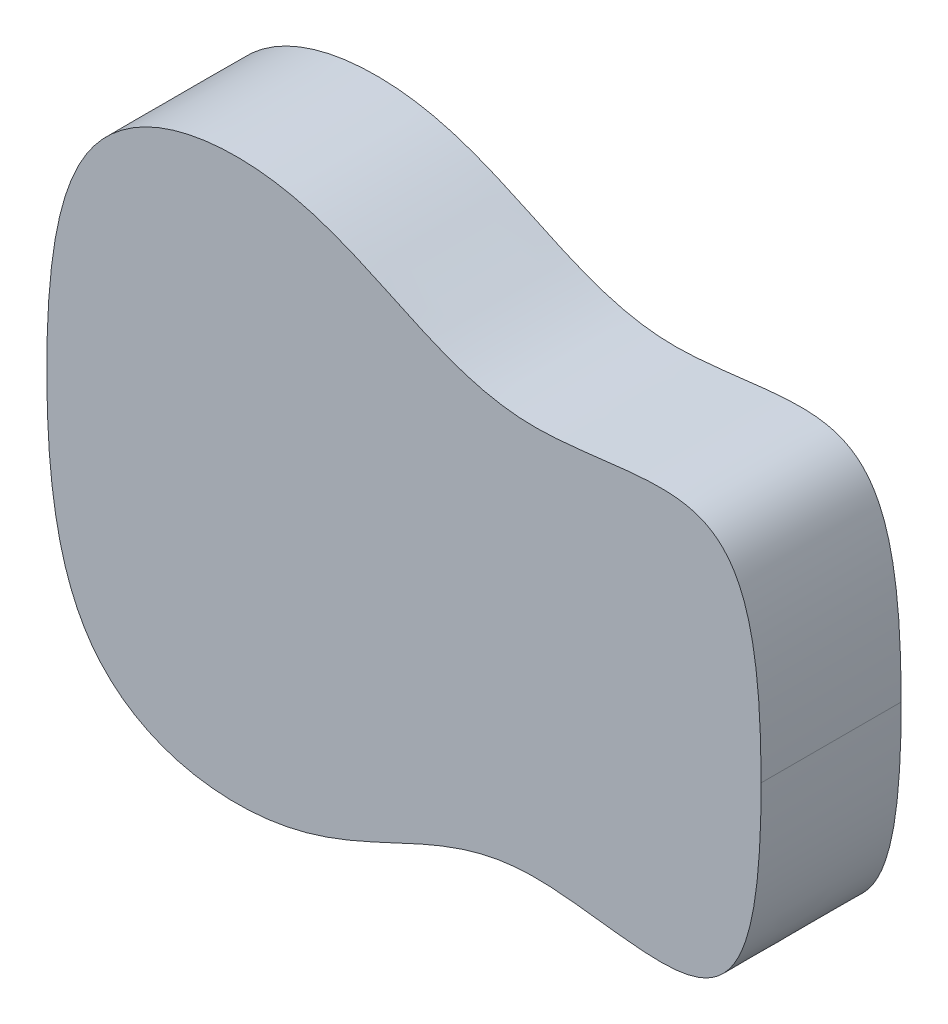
ISO-10303-21;
HEADER;
FILE_DESCRIPTION(('STEP AP214'),'2;1');
FILE_NAME('part.step','',(''),(''),'','','');
FILE_SCHEMA(('AUTOMOTIVE_DESIGN { 1 0 10303 214 1 1 1 1 }'));
ENDSEC;
DATA;
#1=APPLICATION_CONTEXT('core data for automotive mechanical design processes');
#2=APPLICATION_PROTOCOL_DEFINITION('international standard','automotive_design',2000,#1);
#3=PRODUCT_CONTEXT('',#1,'mechanical');
#4=PRODUCT('Part','Part','',(#3));
#5=PRODUCT_RELATED_PRODUCT_CATEGORY('part','',(#4));
#6=PRODUCT_DEFINITION_FORMATION('','',#4);
#7=PRODUCT_DEFINITION_CONTEXT('part definition',#1,'design');
#8=PRODUCT_DEFINITION('design','',#6,#7);
#9=PRODUCT_DEFINITION_SHAPE('','',#8);
#10=(LENGTH_UNIT() NAMED_UNIT(*) SI_UNIT(.MILLI.,.METRE.));
#11=(NAMED_UNIT(*) PLANE_ANGLE_UNIT() SI_UNIT($,.RADIAN.));
#12=(NAMED_UNIT(*) SI_UNIT($,.STERADIAN.) SOLID_ANGLE_UNIT());
#13=UNCERTAINTY_MEASURE_WITH_UNIT(LENGTH_MEASURE(1.E-05),#10,'distance_accuracy_value','');
#14=(GEOMETRIC_REPRESENTATION_CONTEXT(3) GLOBAL_UNCERTAINTY_ASSIGNED_CONTEXT((#13)) GLOBAL_UNIT_ASSIGNED_CONTEXT((#10,
#11,#12)) REPRESENTATION_CONTEXT('',''));
#15=CARTESIAN_POINT('',(0.,0.,0.));
#16=DIRECTION('',(0.,0.,1.));
#17=DIRECTION('',(1.,0.,0.));
#18=AXIS2_PLACEMENT_3D('',#15,#16,#17);
#19=CARTESIAN_POINT('',(0.,0.,100.));
#20=CARTESIAN_POINT('',(0.,-71.6690537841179,100.));
#21=CARTESIAN_POINT('',(21.8850034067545,-187.667022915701,100.));
#22=CARTESIAN_POINT('',(201.910389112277,-219.679273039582,100.));
#23=CARTESIAN_POINT('',(295.60182115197,-117.879681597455,100.));
#24=CARTESIAN_POINT('',(475.293777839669,-163.011614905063,100.));
#25=CARTESIAN_POINT('',(510.,-115.018525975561,100.));
#26=CARTESIAN_POINT('',(510.,1.22345029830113E-13,100.));
#27=B_SPLINE_CURVE_WITH_KNOTS('',3,(#19,#20,#21,#22,#23,#24,#25,#26),.UNSPECIFIED.,.F.,.F.,(4,1,
1,1,1,4),(0.,0.13085445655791,0.316703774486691,0.624722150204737,0.773546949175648,1.),.UNSPECIFIED.);
#28=DIRECTION('',(0.,0.,-1.));
#29=VECTOR('',#28,1.);
#30=SURFACE_OF_LINEAR_EXTRUSION('',#27,#29);
#31=CARTESIAN_POINT('',(0.,0.,0.));
#32=CARTESIAN_POINT('',(0.,-71.6690537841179,0.));
#33=CARTESIAN_POINT('',(21.8850034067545,-187.667022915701,0.));
#34=CARTESIAN_POINT('',(201.910389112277,-219.679273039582,0.));
#35=CARTESIAN_POINT('',(295.60182115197,-117.879681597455,0.));
#36=CARTESIAN_POINT('',(475.293777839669,-163.011614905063,0.));
#37=CARTESIAN_POINT('',(510.,-115.018525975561,0.));
#38=CARTESIAN_POINT('',(510.,1.22345029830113E-13,0.));
#39=B_SPLINE_CURVE_WITH_KNOTS('',3,(#31,#32,#33,#34,#35,#36,#37,#38),.UNSPECIFIED.,.F.,.F.,(4,1,
1,1,1,4),(0.,0.13085445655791,0.316703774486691,0.624722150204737,0.773546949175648,1.),.UNSPECIFIED.);
#40=CARTESIAN_POINT('',(0.,0.,0.));
#41=VERTEX_POINT('',#40);
#42=CARTESIAN_POINT('',(510.,-1.22345029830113E-13,0.));
#43=VERTEX_POINT('',#42);
#44=EDGE_CURVE('E64',#41,#43,#39,.T.);
#45=ORIENTED_EDGE('',*,*,#44,.T.);
#46=DIRECTION('',(0.,0.,-1.));
#47=VECTOR('',#46,1.);
#48=CARTESIAN_POINT('',(510.,-1.22345029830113E-13,100.));
#49=LINE('',#48,#47);
#50=CARTESIAN_POINT('',(510.,-1.22345029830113E-13,100.));
#51=VERTEX_POINT('',#50);
#52=EDGE_CURVE('E11',#51,#43,#49,.T.);
#53=ORIENTED_EDGE('',*,*,#52,.F.);
#54=CARTESIAN_POINT('',(0.,0.,100.));
#55=VERTEX_POINT('',#54);
#56=EDGE_CURVE('E63',#55,#51,#27,.T.);
#57=ORIENTED_EDGE('',*,*,#56,.F.);
#58=DIRECTION('',(0.,0.,-1.));
#59=VECTOR('',#58,1.);
#60=CARTESIAN_POINT('',(0.,0.,100.));
#61=LINE('',#60,#59);
#62=EDGE_CURVE('E41',#55,#41,#61,.T.);
#63=ORIENTED_EDGE('',*,*,#62,.T.);
#64=EDGE_LOOP('',(#45,#53,#57,#63));
#65=FACE_BOUND('',#64,.T.);
#66=ADVANCED_FACE('F32',(#65),#30,.F.);
#67=CARTESIAN_POINT('',(510.,-1.22345029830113E-13,100.));
#68=CARTESIAN_POINT('',(510.,115.018525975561,100.));
#69=CARTESIAN_POINT('',(475.293777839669,163.011614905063,100.));
#70=CARTESIAN_POINT('',(295.60182115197,117.879681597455,100.));
#71=CARTESIAN_POINT('',(201.910389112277,219.679273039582,100.));
#72=CARTESIAN_POINT('',(21.8850034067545,187.667022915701,100.));
#73=CARTESIAN_POINT('',(0.,71.6690537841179,100.));
#74=CARTESIAN_POINT('',(0.,0.,100.));
#75=B_SPLINE_CURVE_WITH_KNOTS('',3,(#67,#68,#69,#70,#71,#72,#73,#74),.UNSPECIFIED.,.F.,.F.,(4,1,
1,1,1,4),(0.,0.226453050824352,0.375277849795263,0.683296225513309,0.86914554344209,1.),.UNSPECIFIED.);
#76=DIRECTION('',(0.,0.,-1.));
#77=VECTOR('',#76,1.);
#78=SURFACE_OF_LINEAR_EXTRUSION('',#75,#77);
#79=CARTESIAN_POINT('',(510.,-1.22345029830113E-13,0.));
#80=CARTESIAN_POINT('',(510.,115.018525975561,0.));
#81=CARTESIAN_POINT('',(475.293777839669,163.011614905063,0.));
#82=CARTESIAN_POINT('',(295.60182115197,117.879681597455,0.));
#83=CARTESIAN_POINT('',(201.910389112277,219.679273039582,0.));
#84=CARTESIAN_POINT('',(21.8850034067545,187.667022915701,0.));
#85=CARTESIAN_POINT('',(0.,71.6690537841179,0.));
#86=CARTESIAN_POINT('',(0.,0.,0.));
#87=B_SPLINE_CURVE_WITH_KNOTS('',3,(#79,#80,#81,#82,#83,#84,#85,#86),.UNSPECIFIED.,.F.,.F.,(4,1,
1,1,1,4),(0.,0.226453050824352,0.375277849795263,0.683296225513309,0.86914554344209,1.),.UNSPECIFIED.);
#88=EDGE_CURVE('E56',#43,#41,#87,.T.);
#89=ORIENTED_EDGE('',*,*,#88,.T.);
#90=ORIENTED_EDGE('',*,*,#62,.F.);
#91=EDGE_CURVE('E48',#51,#55,#75,.T.);
#92=ORIENTED_EDGE('',*,*,#91,.F.);
#93=ORIENTED_EDGE('',*,*,#52,.T.);
#94=EDGE_LOOP('',(#89,#90,#92,#93));
#95=FACE_BOUND('',#94,.T.);
#96=ADVANCED_FACE('F59',(#95),#78,.F.);
#97=CARTESIAN_POINT('',(267.576224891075,-159.079352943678,100.));
#98=DIRECTION('',(0.,0.,-1.));
#99=DIRECTION('',(-1.,0.,0.));
#100=AXIS2_PLACEMENT_3D('',#97,#98,#99);
#101=PLANE('',#100);
#102=ORIENTED_EDGE('',*,*,#56,.T.);
#103=ORIENTED_EDGE('',*,*,#91,.T.);
#104=EDGE_LOOP('',(#102,#103));
#105=FACE_BOUND('',#104,.T.);
#106=ADVANCED_FACE('F91',(#105),#101,.F.);
#107=CARTESIAN_POINT('',(267.576224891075,-159.079352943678,0.));
#108=DIRECTION('',(0.,0.,-1.));
#109=DIRECTION('',(-1.,0.,0.));
#110=AXIS2_PLACEMENT_3D('',#107,#108,#109);
#111=PLANE('',#110);
#112=ORIENTED_EDGE('',*,*,#44,.F.);
#113=ORIENTED_EDGE('',*,*,#88,.F.);
#114=EDGE_LOOP('',(#112,#113));
#115=FACE_BOUND('',#114,.T.);
#116=ADVANCED_FACE('F67',(#115),#111,.T.);
#117=CLOSED_SHELL('',(#66,#96,#106,#116));
#118=MANIFOLD_SOLID_BREP('B2',#117);
#119=ADVANCED_BREP_SHAPE_REPRESENTATION('',(#18,#118),#14);
#120=SHAPE_DEFINITION_REPRESENTATION(#9,#119);
ENDSEC;
END-ISO-10303-21;
